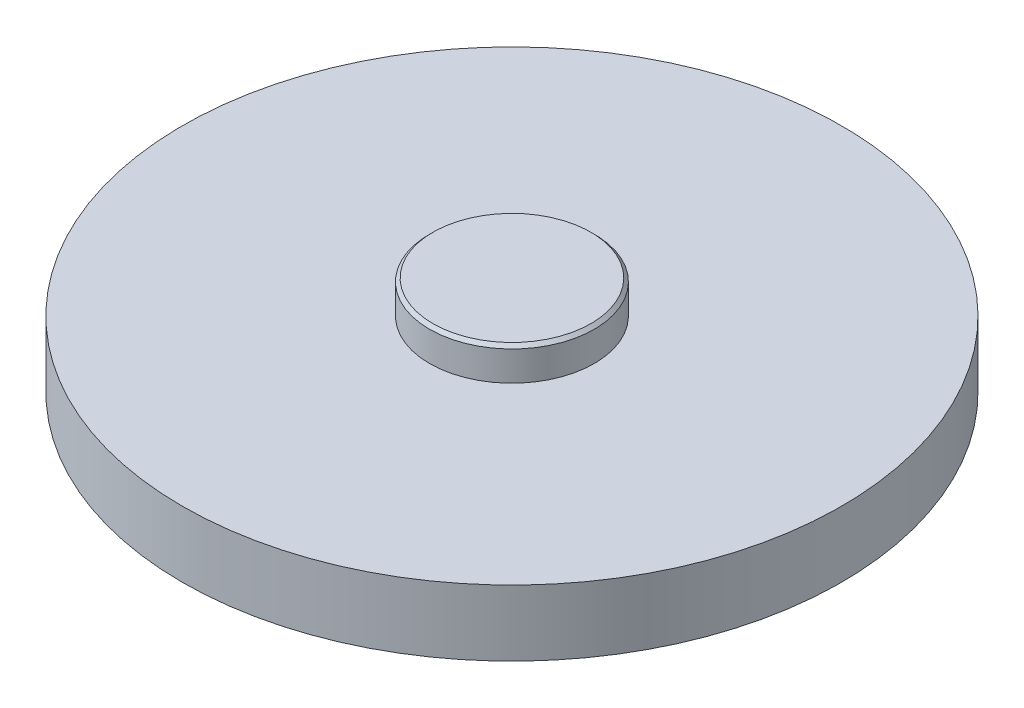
ISO-10303-21;
HEADER;
FILE_DESCRIPTION(('STEP AP214'),'2;1');
FILE_NAME('part.step','',(''),(''),'','','');
FILE_SCHEMA(('AUTOMOTIVE_DESIGN { 1 0 10303 214 1 1 1 1 }'));
ENDSEC;
DATA;
#1=APPLICATION_CONTEXT('core data for automotive mechanical design processes');
#2=APPLICATION_PROTOCOL_DEFINITION('international standard','automotive_design',2000,#1);
#3=PRODUCT_CONTEXT('',#1,'mechanical');
#4=PRODUCT('Part','Part','',(#3));
#5=PRODUCT_RELATED_PRODUCT_CATEGORY('part','',(#4));
#6=PRODUCT_DEFINITION_FORMATION('','',#4);
#7=PRODUCT_DEFINITION_CONTEXT('part definition',#1,'design');
#8=PRODUCT_DEFINITION('design','',#6,#7);
#9=PRODUCT_DEFINITION_SHAPE('','',#8);
#10=(LENGTH_UNIT() NAMED_UNIT(*) SI_UNIT(.MILLI.,.METRE.));
#11=(NAMED_UNIT(*) PLANE_ANGLE_UNIT() SI_UNIT($,.RADIAN.));
#12=(NAMED_UNIT(*) SI_UNIT($,.STERADIAN.) SOLID_ANGLE_UNIT());
#13=UNCERTAINTY_MEASURE_WITH_UNIT(LENGTH_MEASURE(1.E-05),#10,'distance_accuracy_value','');
#14=(GEOMETRIC_REPRESENTATION_CONTEXT(3) GLOBAL_UNCERTAINTY_ASSIGNED_CONTEXT((#13)) GLOBAL_UNIT_ASSIGNED_CONTEXT((#10,
#11,#12)) REPRESENTATION_CONTEXT('',''));
#15=CARTESIAN_POINT('',(0.,0.,0.));
#16=DIRECTION('',(0.,0.,1.));
#17=DIRECTION('',(1.,0.,0.));
#18=AXIS2_PLACEMENT_3D('',#15,#16,#17);
#19=CARTESIAN_POINT('',(0.,0.,0.));
#20=DIRECTION('',(0.,1.,0.));
#21=DIRECTION('',(0.,0.,1.));
#22=AXIS2_PLACEMENT_3D('',#19,#20,#21);
#23=PLANE('',#22);
#24=CARTESIAN_POINT('',(0.,0.,0.));
#25=DIRECTION('',(0.,1.,0.));
#26=DIRECTION('',(0.,0.,1.));
#27=AXIS2_PLACEMENT_3D('',#24,#25,#26);
#28=CIRCLE('',#27,100.);
#29=CARTESIAN_POINT('',(0.,0.,100.));
#30=VERTEX_POINT('',#29);
#31=EDGE_CURVE('E121',#30,#30,#28,.T.);
#32=ORIENTED_EDGE('',*,*,#31,.F.);
#33=EDGE_LOOP('',(#32));
#34=FACE_BOUND('',#33,.T.);
#35=DIRECTION('',(0.,0.,-1.));
#36=VECTOR('',#35,1.);
#37=CARTESIAN_POINT('',(-10.,0.,-20.));
#38=LINE('',#37,#36);
#39=CARTESIAN_POINT('',(-10.,0.,20.));
#40=VERTEX_POINT('',#39);
#41=CARTESIAN_POINT('',(-10.,0.,-20.));
#42=VERTEX_POINT('',#41);
#43=EDGE_CURVE('E90',#40,#42,#38,.T.);
#44=ORIENTED_EDGE('',*,*,#43,.F.);
#45=DIRECTION('',(-1.,0.,0.));
#46=VECTOR('',#45,1.);
#47=CARTESIAN_POINT('',(10.,0.,20.));
#48=LINE('',#47,#46);
#49=CARTESIAN_POINT('',(10.,0.,20.));
#50=VERTEX_POINT('',#49);
#51=EDGE_CURVE('E97',#50,#40,#48,.T.);
#52=ORIENTED_EDGE('',*,*,#51,.F.);
#53=DIRECTION('',(0.,0.,1.));
#54=VECTOR('',#53,1.);
#55=CARTESIAN_POINT('',(10.,0.,-20.));
#56=LINE('',#55,#54);
#57=CARTESIAN_POINT('',(10.,0.,-20.));
#58=VERTEX_POINT('',#57);
#59=EDGE_CURVE('E108',#58,#50,#56,.T.);
#60=ORIENTED_EDGE('',*,*,#59,.F.);
#61=DIRECTION('',(1.,0.,0.));
#62=VECTOR('',#61,1.);
#63=CARTESIAN_POINT('',(10.,0.,-20.));
#64=LINE('',#63,#62);
#65=EDGE_CURVE('E105',#42,#58,#64,.T.);
#66=ORIENTED_EDGE('',*,*,#65,.F.);
#67=EDGE_LOOP('',(#44,#52,#60,#66));
#68=FACE_BOUND('',#67,.T.);
#69=ADVANCED_FACE('F33',(#34,#68),#23,.F.);
#70=CARTESIAN_POINT('',(0.,20.,0.));
#71=DIRECTION('',(0.,-1.,0.));
#72=DIRECTION('',(0.,0.,-1.));
#73=AXIS2_PLACEMENT_3D('',#70,#71,#72);
#74=CYLINDRICAL_SURFACE('',#73,100.);
#75=CARTESIAN_POINT('',(0.,20.,0.));
#76=DIRECTION('',(0.,1.,0.));
#77=DIRECTION('',(0.,0.,1.));
#78=AXIS2_PLACEMENT_3D('',#75,#76,#77);
#79=CIRCLE('',#78,100.);
#80=CARTESIAN_POINT('',(0.,20.,100.));
#81=VERTEX_POINT('',#80);
#82=EDGE_CURVE('E122',#81,#81,#79,.T.);
#83=ORIENTED_EDGE('',*,*,#82,.F.);
#84=EDGE_LOOP('',(#83));
#85=FACE_BOUND('',#84,.T.);
#86=ORIENTED_EDGE('',*,*,#31,.T.);
#87=EDGE_LOOP('',(#86));
#88=FACE_BOUND('',#87,.T.);
#89=ADVANCED_FACE('F179',(#85,#88),#74,.T.);
#90=CARTESIAN_POINT('',(0.,20.,0.));
#91=DIRECTION('',(0.,1.,0.));
#92=DIRECTION('',(0.,0.,1.));
#93=AXIS2_PLACEMENT_3D('',#90,#91,#92);
#94=PLANE('',#93);
#95=CARTESIAN_POINT('',(0.,20.,0.));
#96=DIRECTION('',(0.,1.,0.));
#97=DIRECTION('',(0.,0.,1.));
#98=AXIS2_PLACEMENT_3D('',#95,#96,#97);
#99=CIRCLE('',#98,25.);
#100=CARTESIAN_POINT('',(0.,20.,25.));
#101=VERTEX_POINT('',#100);
#102=EDGE_CURVE('E118',#101,#101,#99,.T.);
#103=ORIENTED_EDGE('',*,*,#102,.F.);
#104=EDGE_LOOP('',(#103));
#105=FACE_BOUND('',#104,.T.);
#106=ORIENTED_EDGE('',*,*,#82,.T.);
#107=EDGE_LOOP('',(#106));
#108=FACE_BOUND('',#107,.T.);
#109=ADVANCED_FACE('F185',(#105,#108),#94,.T.);
#110=CARTESIAN_POINT('',(0.,30.,0.));
#111=DIRECTION('',(0.,-1.,0.));
#112=DIRECTION('',(0.,0.,-1.));
#113=AXIS2_PLACEMENT_3D('',#110,#111,#112);
#114=CYLINDRICAL_SURFACE('',#113,25.);
#115=CARTESIAN_POINT('',(0.,29.,0.));
#116=DIRECTION('',(0.,1.,0.));
#117=DIRECTION('',(0.,0.,1.));
#118=AXIS2_PLACEMENT_3D('',#115,#116,#117);
#119=CIRCLE('',#118,25.);
#120=CARTESIAN_POINT('',(0.,29.,25.));
#121=VERTEX_POINT('',#120);
#122=EDGE_CURVE('E130',#121,#121,#119,.F.);
#123=ORIENTED_EDGE('',*,*,#122,.T.);
#124=EDGE_LOOP('',(#123));
#125=FACE_BOUND('',#124,.T.);
#126=ORIENTED_EDGE('',*,*,#102,.T.);
#127=EDGE_LOOP('',(#126));
#128=FACE_BOUND('',#127,.T.);
#129=ADVANCED_FACE('F248',(#125,#128),#114,.T.);
#130=CARTESIAN_POINT('',(0.,30.,0.));
#131=DIRECTION('',(0.,1.,0.));
#132=DIRECTION('',(0.,0.,1.));
#133=AXIS2_PLACEMENT_3D('',#130,#131,#132);
#134=PLANE('',#133);
#135=CARTESIAN_POINT('',(0.,30.,0.));
#136=DIRECTION('',(0.,1.,0.));
#137=DIRECTION('',(0.,0.,1.));
#138=AXIS2_PLACEMENT_3D('',#135,#136,#137);
#139=CIRCLE('',#138,24.);
#140=CARTESIAN_POINT('',(0.,30.,24.));
#141=VERTEX_POINT('',#140);
#142=EDGE_CURVE('E125',#141,#141,#139,.T.);
#143=ORIENTED_EDGE('',*,*,#142,.T.);
#144=EDGE_LOOP('',(#143));
#145=FACE_BOUND('',#144,.T.);
#146=ADVANCED_FACE('F194',(#145),#134,.T.);
#147=CARTESIAN_POINT('',(0.,30.,0.));
#148=DIRECTION('',(0.,-1.,0.));
#149=DIRECTION('',(0.,0.,-1.));
#150=AXIS2_PLACEMENT_3D('',#147,#148,#149);
#151=CONICAL_SURFACE('',#150,24.,0.785398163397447);
#152=ORIENTED_EDGE('',*,*,#122,.F.);
#153=EDGE_LOOP('',(#152));
#154=FACE_BOUND('',#153,.T.);
#155=ORIENTED_EDGE('',*,*,#142,.F.);
#156=EDGE_LOOP('',(#155));
#157=FACE_BOUND('',#156,.T.);
#158=ADVANCED_FACE('F176',(#154,#157),#151,.T.);
#159=CARTESIAN_POINT('',(-10.,-20.,-20.));
#160=DIRECTION('',(1.,0.,0.));
#161=DIRECTION('',(0.,0.,-1.));
#162=AXIS2_PLACEMENT_3D('',#159,#160,#161);
#163=PLANE('',#162);
#164=DIRECTION('',(0.,1.,0.));
#165=VECTOR('',#164,1.);
#166=CARTESIAN_POINT('',(-10.,-20.,-20.));
#167=LINE('',#166,#165);
#168=CARTESIAN_POINT('',(-10.,-19.,-20.));
#169=VERTEX_POINT('',#168);
#170=EDGE_CURVE('E116',#169,#42,#167,.T.);
#171=ORIENTED_EDGE('',*,*,#170,.F.);
#172=DIRECTION('',(0.,0.,1.));
#173=VECTOR('',#172,1.);
#174=CARTESIAN_POINT('',(-10.,-19.,20.));
#175=LINE('',#174,#173);
#176=CARTESIAN_POINT('',(-10.,-19.,20.));
#177=VERTEX_POINT('',#176);
#178=EDGE_CURVE('E11',#169,#177,#175,.T.);
#179=ORIENTED_EDGE('',*,*,#178,.T.);
#180=DIRECTION('',(0.,1.,0.));
#181=VECTOR('',#180,1.);
#182=CARTESIAN_POINT('',(-10.,-20.,20.));
#183=LINE('',#182,#181);
#184=EDGE_CURVE('E87',#177,#40,#183,.T.);
#185=ORIENTED_EDGE('',*,*,#184,.T.);
#186=ORIENTED_EDGE('',*,*,#43,.T.);
#187=EDGE_LOOP('',(#171,#179,#185,#186));
#188=FACE_BOUND('',#187,.T.);
#189=ADVANCED_FACE('F89',(#188),#163,.F.);
#190=CARTESIAN_POINT('',(10.,-20.,-20.));
#191=DIRECTION('',(0.,0.,1.));
#192=DIRECTION('',(1.,0.,0.));
#193=AXIS2_PLACEMENT_3D('',#190,#191,#192);
#194=PLANE('',#193);
#195=DIRECTION('',(0.,1.,0.));
#196=VECTOR('',#195,1.);
#197=CARTESIAN_POINT('',(10.,-20.,-20.));
#198=LINE('',#197,#196);
#199=CARTESIAN_POINT('',(10.,-19.,-20.));
#200=VERTEX_POINT('',#199);
#201=EDGE_CURVE('E114',#200,#58,#198,.T.);
#202=ORIENTED_EDGE('',*,*,#201,.F.);
#203=DIRECTION('',(-1.,0.,0.));
#204=VECTOR('',#203,1.);
#205=CARTESIAN_POINT('',(-10.,-19.,-20.));
#206=LINE('',#205,#204);
#207=EDGE_CURVE('E42',#200,#169,#206,.T.);
#208=ORIENTED_EDGE('',*,*,#207,.T.);
#209=ORIENTED_EDGE('',*,*,#170,.T.);
#210=ORIENTED_EDGE('',*,*,#65,.T.);
#211=EDGE_LOOP('',(#202,#208,#209,#210));
#212=FACE_BOUND('',#211,.T.);
#213=ADVANCED_FACE('F168',(#212),#194,.F.);
#214=CARTESIAN_POINT('',(10.,-20.,-20.));
#215=DIRECTION('',(-1.,0.,0.));
#216=DIRECTION('',(0.,0.,1.));
#217=AXIS2_PLACEMENT_3D('',#214,#215,#216);
#218=PLANE('',#217);
#219=DIRECTION('',(0.,1.,0.));
#220=VECTOR('',#219,1.);
#221=CARTESIAN_POINT('',(10.,-20.,20.));
#222=LINE('',#221,#220);
#223=CARTESIAN_POINT('',(10.,-19.,20.));
#224=VERTEX_POINT('',#223);
#225=EDGE_CURVE('E96',#224,#50,#222,.T.);
#226=ORIENTED_EDGE('',*,*,#225,.F.);
#227=DIRECTION('',(0.,0.,-1.));
#228=VECTOR('',#227,1.);
#229=CARTESIAN_POINT('',(10.,-19.,-20.));
#230=LINE('',#229,#228);
#231=EDGE_CURVE('E57',#224,#200,#230,.T.);
#232=ORIENTED_EDGE('',*,*,#231,.T.);
#233=ORIENTED_EDGE('',*,*,#201,.T.);
#234=ORIENTED_EDGE('',*,*,#59,.T.);
#235=EDGE_LOOP('',(#226,#232,#233,#234));
#236=FACE_BOUND('',#235,.T.);
#237=ADVANCED_FACE('F167',(#236),#218,.F.);
#238=CARTESIAN_POINT('',(10.,-20.,20.));
#239=DIRECTION('',(0.,0.,-1.));
#240=DIRECTION('',(-1.,0.,0.));
#241=AXIS2_PLACEMENT_3D('',#238,#239,#240);
#242=PLANE('',#241);
#243=ORIENTED_EDGE('',*,*,#184,.F.);
#244=DIRECTION('',(1.,0.,0.));
#245=VECTOR('',#244,1.);
#246=CARTESIAN_POINT('',(10.,-19.,20.));
#247=LINE('',#246,#245);
#248=EDGE_CURVE('E142',#177,#224,#247,.T.);
#249=ORIENTED_EDGE('',*,*,#248,.T.);
#250=ORIENTED_EDGE('',*,*,#225,.T.);
#251=ORIENTED_EDGE('',*,*,#51,.T.);
#252=EDGE_LOOP('',(#243,#249,#250,#251));
#253=FACE_BOUND('',#252,.T.);
#254=ADVANCED_FACE('F107',(#253),#242,.F.);
#255=CARTESIAN_POINT('',(0.,-20.,0.));
#256=DIRECTION('',(0.,-1.,0.));
#257=DIRECTION('',(0.,0.,-1.));
#258=AXIS2_PLACEMENT_3D('',#255,#256,#257);
#259=PLANE('',#258);
#260=DIRECTION('',(0.,0.,1.));
#261=VECTOR('',#260,1.);
#262=CARTESIAN_POINT('',(9.,-20.,20.));
#263=LINE('',#262,#261);
#264=CARTESIAN_POINT('',(9.,-20.,-19.));
#265=VERTEX_POINT('',#264);
#266=CARTESIAN_POINT('',(9.,-20.,19.));
#267=VERTEX_POINT('',#266);
#268=EDGE_CURVE('E137',#265,#267,#263,.T.);
#269=ORIENTED_EDGE('',*,*,#268,.T.);
#270=DIRECTION('',(-1.,0.,0.));
#271=VECTOR('',#270,1.);
#272=CARTESIAN_POINT('',(-10.,-20.,19.));
#273=LINE('',#272,#271);
#274=CARTESIAN_POINT('',(-9.,-20.,19.));
#275=VERTEX_POINT('',#274);
#276=EDGE_CURVE('E139',#267,#275,#273,.T.);
#277=ORIENTED_EDGE('',*,*,#276,.T.);
#278=DIRECTION('',(0.,0.,-1.));
#279=VECTOR('',#278,1.);
#280=CARTESIAN_POINT('',(-9.,-20.,-20.));
#281=LINE('',#280,#279);
#282=CARTESIAN_POINT('',(-9.,-20.,-19.));
#283=VERTEX_POINT('',#282);
#284=EDGE_CURVE('E133',#275,#283,#281,.T.);
#285=ORIENTED_EDGE('',*,*,#284,.T.);
#286=DIRECTION('',(1.,0.,0.));
#287=VECTOR('',#286,1.);
#288=CARTESIAN_POINT('',(10.,-20.,-19.));
#289=LINE('',#288,#287);
#290=EDGE_CURVE('E135',#283,#265,#289,.T.);
#291=ORIENTED_EDGE('',*,*,#290,.T.);
#292=EDGE_LOOP('',(#269,#277,#285,#291));
#293=FACE_BOUND('',#292,.T.);
#294=ADVANCED_FACE('F203',(#293),#259,.T.);
#295=CARTESIAN_POINT('',(0.,-20.,-19.));
#296=DIRECTION('',(0.,-0.707106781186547,-0.707106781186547));
#297=DIRECTION('',(-1.,0.,0.));
#298=AXIS2_PLACEMENT_3D('',#295,#296,#297);
#299=PLANE('',#298);
#300=DIRECTION('',(0.577350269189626,-0.577350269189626,0.577350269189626));
#301=VECTOR('',#300,1.);
#302=CARTESIAN_POINT('',(-2.66666666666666,-26.3333333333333,-12.6666666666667));
#303=LINE('',#302,#301);
#304=EDGE_CURVE('E149',#169,#283,#303,.T.);
#305=ORIENTED_EDGE('',*,*,#304,.F.);
#306=ORIENTED_EDGE('',*,*,#207,.F.);
#307=DIRECTION('',(-0.577350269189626,-0.577350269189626,0.577350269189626));
#308=VECTOR('',#307,1.);
#309=CARTESIAN_POINT('',(6.,-23.,-16.));
#310=LINE('',#309,#308);
#311=EDGE_CURVE('E37',#265,#200,#310,.F.);
#312=ORIENTED_EDGE('',*,*,#311,.F.);
#313=ORIENTED_EDGE('',*,*,#290,.F.);
#314=EDGE_LOOP('',(#305,#306,#312,#313));
#315=FACE_BOUND('',#314,.T.);
#316=ADVANCED_FACE('F35',(#315),#299,.T.);
#317=CARTESIAN_POINT('',(9.,-20.,0.));
#318=DIRECTION('',(0.707106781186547,-0.707106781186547,0.));
#319=DIRECTION('',(0.,0.,-1.));
#320=AXIS2_PLACEMENT_3D('',#317,#318,#319);
#321=PLANE('',#320);
#322=ORIENTED_EDGE('',*,*,#311,.T.);
#323=ORIENTED_EDGE('',*,*,#231,.F.);
#324=DIRECTION('',(-0.577350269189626,-0.577350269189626,-0.577350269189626));
#325=VECTOR('',#324,1.);
#326=CARTESIAN_POINT('',(2.66666666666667,-26.3333333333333,12.6666666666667));
#327=LINE('',#326,#325);
#328=EDGE_CURVE('E148',#267,#224,#327,.F.);
#329=ORIENTED_EDGE('',*,*,#328,.F.);
#330=ORIENTED_EDGE('',*,*,#268,.F.);
#331=EDGE_LOOP('',(#322,#323,#329,#330));
#332=FACE_BOUND('',#331,.T.);
#333=ADVANCED_FACE('F158',(#332),#321,.T.);
#334=CARTESIAN_POINT('',(-9.,-20.,0.));
#335=DIRECTION('',(-0.707106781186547,-0.707106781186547,0.));
#336=DIRECTION('',(0.,0.,1.));
#337=AXIS2_PLACEMENT_3D('',#334,#335,#336);
#338=PLANE('',#337);
#339=ORIENTED_EDGE('',*,*,#304,.T.);
#340=ORIENTED_EDGE('',*,*,#284,.F.);
#341=DIRECTION('',(-0.577350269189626,0.577350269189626,0.577350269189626));
#342=VECTOR('',#341,1.);
#343=CARTESIAN_POINT('',(-2.66666666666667,-26.3333333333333,12.6666666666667));
#344=LINE('',#343,#342);
#345=EDGE_CURVE('E146',#177,#275,#344,.F.);
#346=ORIENTED_EDGE('',*,*,#345,.F.);
#347=ORIENTED_EDGE('',*,*,#178,.F.);
#348=EDGE_LOOP('',(#339,#340,#346,#347));
#349=FACE_BOUND('',#348,.T.);
#350=ADVANCED_FACE('F163',(#349),#338,.T.);
#351=CARTESIAN_POINT('',(0.,-20.,19.));
#352=DIRECTION('',(0.,-0.707106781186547,0.707106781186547));
#353=DIRECTION('',(1.,0.,0.));
#354=AXIS2_PLACEMENT_3D('',#351,#352,#353);
#355=PLANE('',#354);
#356=ORIENTED_EDGE('',*,*,#328,.T.);
#357=ORIENTED_EDGE('',*,*,#248,.F.);
#358=ORIENTED_EDGE('',*,*,#345,.T.);
#359=ORIENTED_EDGE('',*,*,#276,.F.);
#360=EDGE_LOOP('',(#356,#357,#358,#359));
#361=FACE_BOUND('',#360,.T.);
#362=ADVANCED_FACE('F166',(#361),#355,.T.);
#363=CLOSED_SHELL('',(#69,#89,#109,#129,#146,#158,#189,#213,#237,#254,#294,#316,#333,#350,#362));
#364=MANIFOLD_SOLID_BREP('B2',#363);
#365=ADVANCED_BREP_SHAPE_REPRESENTATION('',(#18,#364),#14);
#366=SHAPE_DEFINITION_REPRESENTATION(#9,#365);
ENDSEC;
END-ISO-10303-21;
